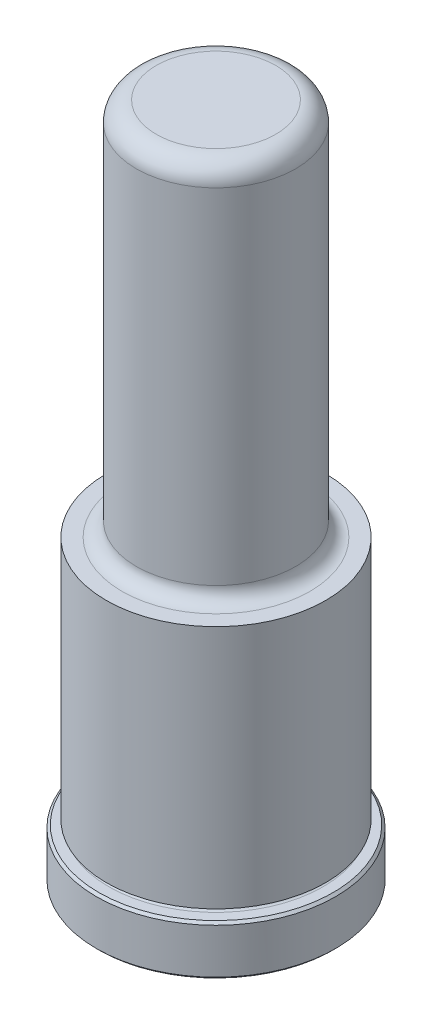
ISO-10303-21;
HEADER;
FILE_DESCRIPTION(('STEP AP214'),'2;1');
FILE_NAME('part.step','',(''),(''),'','','');
FILE_SCHEMA(('AUTOMOTIVE_DESIGN { 1 0 10303 214 1 1 1 1 }'));
ENDSEC;
DATA;
#1=APPLICATION_CONTEXT('core data for automotive mechanical design processes');
#2=APPLICATION_PROTOCOL_DEFINITION('international standard','automotive_design',2000,#1);
#3=PRODUCT_CONTEXT('',#1,'mechanical');
#4=PRODUCT('Part','Part','',(#3));
#5=PRODUCT_RELATED_PRODUCT_CATEGORY('part','',(#4));
#6=PRODUCT_DEFINITION_FORMATION('','',#4);
#7=PRODUCT_DEFINITION_CONTEXT('part definition',#1,'design');
#8=PRODUCT_DEFINITION('design','',#6,#7);
#9=PRODUCT_DEFINITION_SHAPE('','',#8);
#10=(LENGTH_UNIT() NAMED_UNIT(*) SI_UNIT(.MILLI.,.METRE.));
#11=(NAMED_UNIT(*) PLANE_ANGLE_UNIT() SI_UNIT($,.RADIAN.));
#12=(NAMED_UNIT(*) SI_UNIT($,.STERADIAN.) SOLID_ANGLE_UNIT());
#13=UNCERTAINTY_MEASURE_WITH_UNIT(LENGTH_MEASURE(1.E-05),#10,'distance_accuracy_value','');
#14=(GEOMETRIC_REPRESENTATION_CONTEXT(3) GLOBAL_UNCERTAINTY_ASSIGNED_CONTEXT((#13)) GLOBAL_UNIT_ASSIGNED_CONTEXT((#10,
#11,#12)) REPRESENTATION_CONTEXT('',''));
#15=CARTESIAN_POINT('',(0.,0.,0.));
#16=DIRECTION('',(0.,0.,1.));
#17=DIRECTION('',(1.,0.,0.));
#18=AXIS2_PLACEMENT_3D('',#15,#16,#17);
#19=CARTESIAN_POINT('',(0.,0.,0.));
#20=DIRECTION('',(0.,1.,0.));
#21=DIRECTION('',(0.,0.,1.));
#22=AXIS2_PLACEMENT_3D('',#19,#20,#21);
#23=PLANE('',#22);
#24=CARTESIAN_POINT('',(0.,0.,0.));
#25=DIRECTION('',(0.,1.,0.));
#26=DIRECTION('',(0.,0.,1.));
#27=AXIS2_PLACEMENT_3D('',#24,#25,#26);
#28=CIRCLE('',#27,18.669);
#29=CARTESIAN_POINT('',(0.,0.,18.669));
#30=VERTEX_POINT('',#29);
#31=EDGE_CURVE('E46',#30,#30,#28,.F.);
#32=ORIENTED_EDGE('',*,*,#31,.T.);
#33=EDGE_LOOP('',(#32));
#34=FACE_BOUND('',#33,.T.);
#35=ADVANCED_FACE('F31',(#34),#23,.F.);
#36=CARTESIAN_POINT('',(0.,0.,0.));
#37=DIRECTION('',(0.,1.,0.));
#38=DIRECTION('',(0.,0.,1.));
#39=AXIS2_PLACEMENT_3D('',#36,#37,#38);
#40=CYLINDRICAL_SURFACE('',#39,19.05);
#41=CARTESIAN_POINT('',(0.,0.380999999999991,0.));
#42=DIRECTION('',(0.,1.,0.));
#43=DIRECTION('',(0.,0.,1.));
#44=AXIS2_PLACEMENT_3D('',#41,#42,#43);
#45=CIRCLE('',#44,19.05);
#46=CARTESIAN_POINT('',(0.,0.380999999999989,19.05));
#47=VERTEX_POINT('',#46);
#48=EDGE_CURVE('E51',#47,#47,#45,.T.);
#49=ORIENTED_EDGE('',*,*,#48,.T.);
#50=EDGE_LOOP('',(#49));
#51=FACE_BOUND('',#50,.T.);
#52=CARTESIAN_POINT('',(0.,7.5438,0.));
#53=DIRECTION('',(0.,-1.,0.));
#54=DIRECTION('',(0.,0.,-1.));
#55=AXIS2_PLACEMENT_3D('',#52,#53,#54);
#56=CIRCLE('',#55,19.05);
#57=CARTESIAN_POINT('',(0.,7.5438,-19.05));
#58=VERTEX_POINT('',#57);
#59=EDGE_CURVE('E54',#58,#58,#56,.T.);
#60=ORIENTED_EDGE('',*,*,#59,.T.);
#61=EDGE_LOOP('',(#60));
#62=FACE_BOUND('',#61,.T.);
#63=ADVANCED_FACE('F110',(#51,#62),#40,.T.);
#64=CARTESIAN_POINT('',(0.,7.9248,-19.05));
#65=DIRECTION('',(0.,-1.,0.));
#66=DIRECTION('',(0.,0.,-1.));
#67=AXIS2_PLACEMENT_3D('',#64,#65,#66);
#68=PLANE('',#67);
#69=CARTESIAN_POINT('',(0.,7.9248,0.));
#70=DIRECTION('',(0.,-1.,0.));
#71=DIRECTION('',(0.,0.,-1.));
#72=AXIS2_PLACEMENT_3D('',#69,#70,#71);
#73=CIRCLE('',#72,18.669);
#74=CARTESIAN_POINT('',(0.,7.9248,-18.669));
#75=VERTEX_POINT('',#74);
#76=EDGE_CURVE('E42',#75,#75,#73,.F.);
#77=ORIENTED_EDGE('',*,*,#76,.T.);
#78=EDGE_LOOP('',(#77));
#79=FACE_BOUND('',#78,.T.);
#80=CARTESIAN_POINT('',(0.,7.9248,0.));
#81=DIRECTION('',(0.,1.,0.));
#82=DIRECTION('',(0.,0.,1.));
#83=AXIS2_PLACEMENT_3D('',#80,#81,#82);
#84=CIRCLE('',#83,17.0688);
#85=CARTESIAN_POINT('',(0.,7.92479999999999,17.0688));
#86=VERTEX_POINT('',#85);
#87=EDGE_CURVE('E57',#86,#86,#84,.T.);
#88=ORIENTED_EDGE('',*,*,#87,.F.);
#89=EDGE_LOOP('',(#88));
#90=FACE_BOUND('',#89,.T.);
#91=ADVANCED_FACE('F105',(#79,#90),#68,.F.);
#92=CARTESIAN_POINT('',(0.,8.3058,0.));
#93=DIRECTION('',(0.,1.,0.));
#94=DIRECTION('',(0.,0.,1.));
#95=AXIS2_PLACEMENT_3D('',#92,#93,#94);
#96=TOROIDAL_SURFACE('',#95,17.0688,0.381000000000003);
#97=CARTESIAN_POINT('',(0.,8.6868,0.));
#98=DIRECTION('',(0.,1.,0.));
#99=DIRECTION('',(0.,0.,1.));
#100=AXIS2_PLACEMENT_3D('',#97,#98,#99);
#101=CIRCLE('',#100,17.0688);
#102=CARTESIAN_POINT('',(0.,8.6868,17.0688));
#103=VERTEX_POINT('',#102);
#104=EDGE_CURVE('E60',#103,#103,#101,.T.);
#105=ORIENTED_EDGE('',*,*,#104,.F.);
#106=EDGE_LOOP('',(#105));
#107=FACE_BOUND('',#106,.T.);
#108=ORIENTED_EDGE('',*,*,#87,.T.);
#109=EDGE_LOOP('',(#108));
#110=FACE_BOUND('',#109,.T.);
#111=ADVANCED_FACE('F99',(#107,#110),#96,.F.);
#112=CARTESIAN_POINT('',(0.,8.6868,-17.0688));
#113=DIRECTION('',(0.,1.,0.));
#114=DIRECTION('',(0.,0.,1.));
#115=AXIS2_PLACEMENT_3D('',#112,#113,#114);
#116=PLANE('',#115);
#117=CARTESIAN_POINT('',(0.,8.6868,0.));
#118=DIRECTION('',(0.,1.,0.));
#119=DIRECTION('',(0.,0.,1.));
#120=AXIS2_PLACEMENT_3D('',#117,#118,#119);
#121=CIRCLE('',#120,17.4752);
#122=CARTESIAN_POINT('',(0.,8.6868,17.4752));
#123=VERTEX_POINT('',#122);
#124=EDGE_CURVE('E63',#123,#123,#121,.T.);
#125=ORIENTED_EDGE('',*,*,#124,.F.);
#126=EDGE_LOOP('',(#125));
#127=FACE_BOUND('',#126,.T.);
#128=ORIENTED_EDGE('',*,*,#104,.T.);
#129=EDGE_LOOP('',(#128));
#130=FACE_BOUND('',#129,.T.);
#131=ADVANCED_FACE('F93',(#127,#130),#116,.F.);
#132=CARTESIAN_POINT('',(0.,0.,0.));
#133=DIRECTION('',(0.,1.,0.));
#134=DIRECTION('',(0.,0.,1.));
#135=AXIS2_PLACEMENT_3D('',#132,#133,#134);
#136=CYLINDRICAL_SURFACE('',#135,17.4752);
#137=CARTESIAN_POINT('',(0.,47.625,0.));
#138=DIRECTION('',(0.,1.,0.));
#139=DIRECTION('',(0.,0.,1.));
#140=AXIS2_PLACEMENT_3D('',#137,#138,#139);
#141=CIRCLE('',#140,17.4752);
#142=CARTESIAN_POINT('',(0.,47.625,17.4752));
#143=VERTEX_POINT('',#142);
#144=EDGE_CURVE('E66',#143,#143,#141,.T.);
#145=ORIENTED_EDGE('',*,*,#144,.F.);
#146=EDGE_LOOP('',(#145));
#147=FACE_BOUND('',#146,.T.);
#148=ORIENTED_EDGE('',*,*,#124,.T.);
#149=EDGE_LOOP('',(#148));
#150=FACE_BOUND('',#149,.T.);
#151=ADVANCED_FACE('F87',(#147,#150),#136,.T.);
#152=CARTESIAN_POINT('',(0.,47.625,-17.4752));
#153=DIRECTION('',(0.,-1.,0.));
#154=DIRECTION('',(0.,0.,-1.));
#155=AXIS2_PLACEMENT_3D('',#152,#153,#154);
#156=PLANE('',#155);
#157=CARTESIAN_POINT('',(0.,47.625,0.));
#158=DIRECTION('',(0.,1.,0.));
#159=DIRECTION('',(0.,0.,1.));
#160=AXIS2_PLACEMENT_3D('',#157,#158,#159);
#161=CIRCLE('',#160,14.9733);
#162=CARTESIAN_POINT('',(0.,47.625,14.9733));
#163=VERTEX_POINT('',#162);
#164=EDGE_CURVE('E69',#163,#163,#161,.T.);
#165=ORIENTED_EDGE('',*,*,#164,.F.);
#166=EDGE_LOOP('',(#165));
#167=FACE_BOUND('',#166,.T.);
#168=ORIENTED_EDGE('',*,*,#144,.T.);
#169=EDGE_LOOP('',(#168));
#170=FACE_BOUND('',#169,.T.);
#171=ADVANCED_FACE('F81',(#167,#170),#156,.F.);
#172=CARTESIAN_POINT('',(0.,49.911,0.));
#173=DIRECTION('',(0.,1.,0.));
#174=DIRECTION('',(0.,0.,1.));
#175=AXIS2_PLACEMENT_3D('',#172,#173,#174);
#176=TOROIDAL_SURFACE('',#175,14.9733,2.286);
#177=CARTESIAN_POINT('',(0.,49.911,0.));
#178=DIRECTION('',(0.,1.,0.));
#179=DIRECTION('',(0.,0.,1.));
#180=AXIS2_PLACEMENT_3D('',#177,#178,#179);
#181=CIRCLE('',#180,12.6873);
#182=CARTESIAN_POINT('',(0.,49.911,12.6873));
#183=VERTEX_POINT('',#182);
#184=EDGE_CURVE('E72',#183,#183,#181,.T.);
#185=ORIENTED_EDGE('',*,*,#184,.F.);
#186=EDGE_LOOP('',(#185));
#187=FACE_BOUND('',#186,.T.);
#188=ORIENTED_EDGE('',*,*,#164,.T.);
#189=EDGE_LOOP('',(#188));
#190=FACE_BOUND('',#189,.T.);
#191=ADVANCED_FACE('F78',(#187,#190),#176,.F.);
#192=CARTESIAN_POINT('',(0.,0.,0.));
#193=DIRECTION('',(0.,1.,0.));
#194=DIRECTION('',(0.,0.,1.));
#195=AXIS2_PLACEMENT_3D('',#192,#193,#194);
#196=CYLINDRICAL_SURFACE('',#195,12.6873);
#197=CARTESIAN_POINT('',(0.,104.775,0.));
#198=DIRECTION('',(0.,-1.,0.));
#199=DIRECTION('',(0.,0.,-1.));
#200=AXIS2_PLACEMENT_3D('',#197,#198,#199);
#201=CIRCLE('',#200,12.6873);
#202=CARTESIAN_POINT('',(0.,104.775,-12.6873));
#203=VERTEX_POINT('',#202);
#204=EDGE_CURVE('E10',#203,#203,#201,.T.);
#205=ORIENTED_EDGE('',*,*,#204,.T.);
#206=EDGE_LOOP('',(#205));
#207=FACE_BOUND('',#206,.T.);
#208=ORIENTED_EDGE('',*,*,#184,.T.);
#209=EDGE_LOOP('',(#208));
#210=FACE_BOUND('',#209,.T.);
#211=ADVANCED_FACE('F76',(#207,#210),#196,.T.);
#212=CARTESIAN_POINT('',(0.,107.95,-12.6873));
#213=DIRECTION('',(0.,-1.,0.));
#214=DIRECTION('',(0.,0.,-1.));
#215=AXIS2_PLACEMENT_3D('',#212,#213,#214);
#216=PLANE('',#215);
#217=CARTESIAN_POINT('',(0.,107.95,0.));
#218=DIRECTION('',(0.,-1.,0.));
#219=DIRECTION('',(0.,0.,-1.));
#220=AXIS2_PLACEMENT_3D('',#217,#218,#219);
#221=CIRCLE('',#220,9.51230000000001);
#222=CARTESIAN_POINT('',(0.,107.95,-9.51229999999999));
#223=VERTEX_POINT('',#222);
#224=EDGE_CURVE('E38',#223,#223,#221,.F.);
#225=ORIENTED_EDGE('',*,*,#224,.T.);
#226=EDGE_LOOP('',(#225));
#227=FACE_BOUND('',#226,.T.);
#228=ADVANCED_FACE('F127',(#227),#216,.F.);
#229=CARTESIAN_POINT('',(0.,0.380999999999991,0.));
#230=DIRECTION('',(0.,1.,0.));
#231=DIRECTION('',(0.,0.,1.));
#232=AXIS2_PLACEMENT_3D('',#229,#230,#231);
#233=CONICAL_SURFACE('',#232,19.05,0.785398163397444);
#234=CARTESIAN_POINT('',(0.,0.,18.669));
#235=CARTESIAN_POINT('',(0.,0.00396874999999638,18.67296875));
#236=CARTESIAN_POINT('',(0.,0.0079374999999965,18.6769375));
#237=CARTESIAN_POINT('',(0.,0.0158749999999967,18.684875));
#238=CARTESIAN_POINT('',(0.,0.0198437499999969,18.68884375));
#239=CARTESIAN_POINT('',(0.,0.0277812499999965,18.69678125));
#240=CARTESIAN_POINT('',(0.,0.031749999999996,18.70075));
#241=CARTESIAN_POINT('',(0.,0.0396874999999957,18.7086875));
#242=CARTESIAN_POINT('',(0.,0.0436562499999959,18.71265625));
#243=CARTESIAN_POINT('',(0.,0.0515937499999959,18.72059375));
#244=CARTESIAN_POINT('',(0.,0.0555624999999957,18.7245625));
#245=CARTESIAN_POINT('',(0.,0.0634999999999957,18.7325));
#246=CARTESIAN_POINT('',(0.,0.0674687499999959,18.73646875));
#247=CARTESIAN_POINT('',(0.,0.0754062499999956,18.74440625));
#248=CARTESIAN_POINT('',(0.,0.0793749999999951,18.748375));
#249=CARTESIAN_POINT('',(0.,0.0873124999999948,18.7563125));
#250=CARTESIAN_POINT('',(0.,0.0912812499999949,18.76028125));
#251=CARTESIAN_POINT('',(0.,0.099218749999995,18.76821875));
#252=CARTESIAN_POINT('',(0.,0.103187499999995,18.7721875));
#253=CARTESIAN_POINT('',(0.,0.111124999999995,18.780125));
#254=CARTESIAN_POINT('',(0.,0.115093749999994,18.78409375));
#255=CARTESIAN_POINT('',(0.,0.123031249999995,18.79203125));
#256=CARTESIAN_POINT('',(0.,0.126999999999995,18.796));
#257=CARTESIAN_POINT('',(0.,0.134937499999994,18.8039375));
#258=CARTESIAN_POINT('',(0.,0.138906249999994,18.80790625));
#259=CARTESIAN_POINT('',(0.,0.146843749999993,18.81584375));
#260=CARTESIAN_POINT('',(0.,0.150812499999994,18.8198125));
#261=CARTESIAN_POINT('',(0.,0.158749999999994,18.82775));
#262=CARTESIAN_POINT('',(0.,0.162718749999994,18.83171875));
#263=CARTESIAN_POINT('',(0.,0.170656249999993,18.83965625));
#264=CARTESIAN_POINT('',(0.,0.174624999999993,18.843625));
#265=CARTESIAN_POINT('',(0.,0.182562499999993,18.8515625));
#266=CARTESIAN_POINT('',(0.,0.186531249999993,18.85553125));
#267=CARTESIAN_POINT('',(0.,0.194468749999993,18.86346875));
#268=CARTESIAN_POINT('',(0.,0.198437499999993,18.8674375));
#269=CARTESIAN_POINT('',(0.,0.206374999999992,18.875375));
#270=CARTESIAN_POINT('',(0.,0.210343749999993,18.87934375));
#271=CARTESIAN_POINT('',(0.,0.218281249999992,18.88728125));
#272=CARTESIAN_POINT('',(0.,0.222249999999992,18.89125));
#273=CARTESIAN_POINT('',(0.,0.230187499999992,18.8991875));
#274=CARTESIAN_POINT('',(0.,0.234156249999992,18.90315625));
#275=CARTESIAN_POINT('',(0.,0.242093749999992,18.91109375));
#276=CARTESIAN_POINT('',(0.,0.246062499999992,18.9150625));
#277=CARTESIAN_POINT('',(0.,0.253999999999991,18.923));
#278=CARTESIAN_POINT('',(0.,0.257968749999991,18.92696875));
#279=CARTESIAN_POINT('',(0.,0.265906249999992,18.93490625));
#280=CARTESIAN_POINT('',(0.,0.269874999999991,18.938875));
#281=CARTESIAN_POINT('',(0.,0.277812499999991,18.9468125));
#282=CARTESIAN_POINT('',(0.,0.281781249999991,18.95078125));
#283=CARTESIAN_POINT('',(0.,0.289718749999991,18.95871875));
#284=CARTESIAN_POINT('',(0.,0.293687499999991,18.9626875));
#285=CARTESIAN_POINT('',(0.,0.301624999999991,18.970625));
#286=CARTESIAN_POINT('',(0.,0.30559374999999,18.97459375));
#287=CARTESIAN_POINT('',(0.,0.31353124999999,18.98253125));
#288=CARTESIAN_POINT('',(0.,0.31749999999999,18.9865));
#289=CARTESIAN_POINT('',(0.,0.32543749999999,18.9944375));
#290=CARTESIAN_POINT('',(0.,0.32940624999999,18.99840625));
#291=CARTESIAN_POINT('',(0.,0.33734374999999,19.00634375));
#292=CARTESIAN_POINT('',(0.,0.34131249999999,19.0103125));
#293=CARTESIAN_POINT('',(0.,0.34924999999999,19.01825));
#294=CARTESIAN_POINT('',(0.,0.353218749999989,19.02221875));
#295=CARTESIAN_POINT('',(0.,0.361156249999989,19.03015625));
#296=CARTESIAN_POINT('',(0.,0.365124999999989,19.034125));
#297=CARTESIAN_POINT('',(0.,0.37306249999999,19.0420625));
#298=CARTESIAN_POINT('',(0.,0.37703124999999,19.04603125));
#299=CARTESIAN_POINT('',(0.,0.380999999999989,19.05));
#300=B_SPLINE_CURVE_WITH_KNOTS('',3,(#234,#235,#236,#237,#238,#239,#240,#241,#242,#243,#244,
#245,#246,#247,#248,#249,#250,#251,#252,#253,#254,#255,#256,#257,#258,#259,#260,#261,#262,#263,
#264,#265,#266,#267,#268,#269,#270,#271,#272,#273,#274,#275,#276,#277,#278,#279,#280,#281,#282,
#283,#284,#285,#286,#287,#288,#289,#290,#291,#292,#293,#294,#295,#296,#297,#298,#299),
.UNSPECIFIED.,.F.,.F.,(4,2,2,2,2,2,2,2,2,2,2,2,2,2,2,2,2,2,2,2,2,2,2,2,2,2,2,2,2,2,2,2,4),(0.,
0.0168379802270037,0.0336759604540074,0.0505139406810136,0.0673519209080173,0.084189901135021,
0.101027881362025,0.117865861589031,0.134703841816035,0.151541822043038,0.168379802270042,
0.185217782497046,0.202055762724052,0.218893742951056,0.235731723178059,0.252569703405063,
0.269407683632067,0.286245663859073,0.303083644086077,0.31992162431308,0.336759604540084,
0.35359758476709,0.370435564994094,0.387273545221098,0.404111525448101,0.420949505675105,
0.437787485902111,0.454625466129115,0.471463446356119,0.488301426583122,0.505139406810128,
0.521977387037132,0.538815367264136),.UNSPECIFIED.);
#301=EDGE_CURVE('BSEAM124',#30,#47,#300,.T.);
#302=ORIENTED_EDGE('',*,*,#31,.F.);
#303=ORIENTED_EDGE('',*,*,#48,.F.);
#304=ORIENTED_EDGE('',*,*,#301,.T.);
#305=ORIENTED_EDGE('',*,*,#301,.F.);
#306=EDGE_LOOP('',(#302,#304,#303,#305));
#307=FACE_BOUND('',#306,.T.);
#308=ADVANCED_FACE('F124',(#307),#233,.T.);
#309=CARTESIAN_POINT('',(0.,7.9248,0.));
#310=DIRECTION('',(0.,-1.,0.));
#311=DIRECTION('',(0.,0.,-1.));
#312=AXIS2_PLACEMENT_3D('',#309,#310,#311);
#313=CONICAL_SURFACE('',#312,18.669,0.785398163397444);
#314=ORIENTED_EDGE('',*,*,#59,.F.);
#315=EDGE_LOOP('',(#314));
#316=FACE_BOUND('',#315,.T.);
#317=ORIENTED_EDGE('',*,*,#76,.F.);
#318=EDGE_LOOP('',(#317));
#319=FACE_BOUND('',#318,.T.);
#320=ADVANCED_FACE('F126',(#316,#319),#313,.T.);
#321=CARTESIAN_POINT('',(0.,104.775,0.));
#322=DIRECTION('',(0.,-1.,0.));
#323=DIRECTION('',(0.,0.,-1.));
#324=AXIS2_PLACEMENT_3D('',#321,#322,#323);
#325=TOROIDAL_SURFACE('',#324,9.51230000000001,3.175);
#326=ORIENTED_EDGE('',*,*,#204,.F.);
#327=EDGE_LOOP('',(#326));
#328=FACE_BOUND('',#327,.T.);
#329=ORIENTED_EDGE('',*,*,#224,.F.);
#330=EDGE_LOOP('',(#329));
#331=FACE_BOUND('',#330,.T.);
#332=ADVANCED_FACE('F33',(#328,#331),#325,.T.);
#333=CLOSED_SHELL('',(#35,#63,#91,#111,#131,#151,#171,#191,#211,#228,#308,#320,#332));
#334=MANIFOLD_SOLID_BREP('B2',#333);
#335=ADVANCED_BREP_SHAPE_REPRESENTATION('',(#18,#334),#14);
#336=SHAPE_DEFINITION_REPRESENTATION(#9,#335);
ENDSEC;
END-ISO-10303-21;
